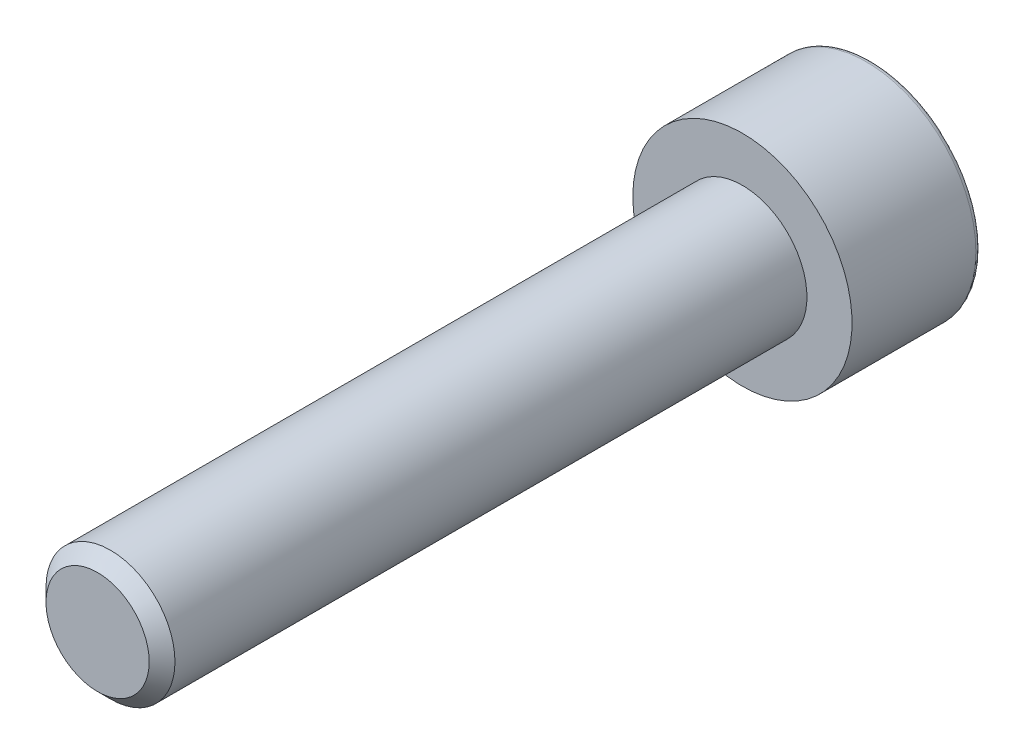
ISO-10303-21;
HEADER;
FILE_DESCRIPTION(('STEP AP214'),'2;1');
FILE_NAME('part.step','',(''),(''),'','','');
FILE_SCHEMA(('AUTOMOTIVE_DESIGN { 1 0 10303 214 1 1 1 1 }'));
ENDSEC;
DATA;
#1=APPLICATION_CONTEXT('core data for automotive mechanical design processes');
#2=APPLICATION_PROTOCOL_DEFINITION('international standard','automotive_design',2000,#1);
#3=PRODUCT_CONTEXT('',#1,'mechanical');
#4=PRODUCT('Part','Part','',(#3));
#5=PRODUCT_RELATED_PRODUCT_CATEGORY('part','',(#4));
#6=PRODUCT_DEFINITION_FORMATION('','',#4);
#7=PRODUCT_DEFINITION_CONTEXT('part definition',#1,'design');
#8=PRODUCT_DEFINITION('design','',#6,#7);
#9=PRODUCT_DEFINITION_SHAPE('','',#8);
#10=(LENGTH_UNIT() NAMED_UNIT(*) SI_UNIT(.MILLI.,.METRE.));
#11=(NAMED_UNIT(*) PLANE_ANGLE_UNIT() SI_UNIT($,.RADIAN.));
#12=(NAMED_UNIT(*) SI_UNIT($,.STERADIAN.) SOLID_ANGLE_UNIT());
#13=UNCERTAINTY_MEASURE_WITH_UNIT(LENGTH_MEASURE(1.E-05),#10,'distance_accuracy_value','');
#14=(GEOMETRIC_REPRESENTATION_CONTEXT(3) GLOBAL_UNCERTAINTY_ASSIGNED_CONTEXT((#13)) GLOBAL_UNIT_ASSIGNED_CONTEXT((#10,
#11,#12)) REPRESENTATION_CONTEXT('',''));
#15=CARTESIAN_POINT('',(0.,0.,0.));
#16=DIRECTION('',(0.,0.,1.));
#17=DIRECTION('',(1.,0.,0.));
#18=AXIS2_PLACEMENT_3D('',#15,#16,#17);
#19=CARTESIAN_POINT('',(0.,0.,0.));
#20=DIRECTION('',(0.,0.,1.));
#21=DIRECTION('',(1.,0.,0.));
#22=AXIS2_PLACEMENT_3D('',#19,#20,#21);
#23=PLANE('',#22);
#24=CARTESIAN_POINT('',(0.,0.,0.));
#25=DIRECTION('',(0.,0.,1.));
#26=DIRECTION('',(1.,0.,0.));
#27=AXIS2_PLACEMENT_3D('',#24,#25,#26);
#28=CIRCLE('',#27,4.05);
#29=CARTESIAN_POINT('',(4.05,0.,0.));
#30=VERTEX_POINT('',#29);
#31=EDGE_CURVE('E44',#30,#30,#28,.F.);
#32=ORIENTED_EDGE('',*,*,#31,.T.);
#33=EDGE_LOOP('',(#32));
#34=FACE_BOUND('',#33,.T.);
#35=CARTESIAN_POINT('',(0.,0.,0.));
#36=DIRECTION('',(0.,0.,-1.));
#37=DIRECTION('',(-1.,0.,0.));
#38=AXIS2_PLACEMENT_3D('',#35,#36,#37);
#39=CIRCLE('',#38,2.3094010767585);
#40=CARTESIAN_POINT('',(2.3094010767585,0.,0.));
#41=VERTEX_POINT('',#40);
#42=CARTESIAN_POINT('',(1.15470053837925,-2.,0.));
#43=VERTEX_POINT('',#42);
#44=EDGE_CURVE('E50',#41,#43,#39,.T.);
#45=ORIENTED_EDGE('',*,*,#44,.F.);
#46=CARTESIAN_POINT('',(1.15470053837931,1.99999999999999,0.));
#47=VERTEX_POINT('',#46);
#48=EDGE_CURVE('E57',#47,#41,#39,.T.);
#49=ORIENTED_EDGE('',*,*,#48,.F.);
#50=CARTESIAN_POINT('',(-1.15470053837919,2.,0.));
#51=VERTEX_POINT('',#50);
#52=EDGE_CURVE('E151',#51,#47,#39,.T.);
#53=ORIENTED_EDGE('',*,*,#52,.F.);
#54=CARTESIAN_POINT('',(-2.3094010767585,0.,0.));
#55=VERTEX_POINT('',#54);
#56=EDGE_CURVE('E148',#55,#51,#39,.T.);
#57=ORIENTED_EDGE('',*,*,#56,.F.);
#58=CARTESIAN_POINT('',(-1.15470053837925,-1.99999999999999,0.));
#59=VERTEX_POINT('',#58);
#60=EDGE_CURVE('E118',#59,#55,#39,.T.);
#61=ORIENTED_EDGE('',*,*,#60,.F.);
#62=EDGE_CURVE('E110',#43,#59,#39,.T.);
#63=ORIENTED_EDGE('',*,*,#62,.F.);
#64=EDGE_LOOP('',(#45,#49,#53,#57,#61,#63));
#65=FACE_BOUND('',#64,.T.);
#66=ADVANCED_FACE('F31',(#34,#65),#23,.F.);
#67=CARTESIAN_POINT('',(0.,-4.25,5.));
#68=DIRECTION('',(0.,0.,-1.));
#69=DIRECTION('',(-1.,0.,0.));
#70=AXIS2_PLACEMENT_3D('',#67,#68,#69);
#71=PLANE('',#70);
#72=CARTESIAN_POINT('',(0.,0.,5.));
#73=DIRECTION('',(0.,0.,1.));
#74=DIRECTION('',(1.,0.,0.));
#75=AXIS2_PLACEMENT_3D('',#72,#73,#74);
#76=CIRCLE('',#75,4.25);
#77=CARTESIAN_POINT('',(-4.25,0.,5.));
#78=VERTEX_POINT('',#77);
#79=EDGE_CURVE('E136',#78,#78,#76,.T.);
#80=ORIENTED_EDGE('',*,*,#79,.T.);
#81=EDGE_LOOP('',(#80));
#82=FACE_BOUND('',#81,.T.);
#83=CARTESIAN_POINT('',(0.,0.,5.));
#84=DIRECTION('',(0.,0.,-1.));
#85=DIRECTION('',(-1.,0.,0.));
#86=AXIS2_PLACEMENT_3D('',#83,#84,#85);
#87=CIRCLE('',#86,2.5);
#88=CARTESIAN_POINT('',(-2.5,0.,5.));
#89=VERTEX_POINT('',#88);
#90=EDGE_CURVE('E184',#89,#89,#87,.F.);
#91=ORIENTED_EDGE('',*,*,#90,.F.);
#92=EDGE_LOOP('',(#91));
#93=FACE_BOUND('',#92,.T.);
#94=ADVANCED_FACE('F209',(#82,#93),#71,.F.);
#95=CARTESIAN_POINT('',(0.,0.,2.975));
#96=DIRECTION('',(0.,0.,-1.));
#97=DIRECTION('',(-1.,0.,0.));
#98=AXIS2_PLACEMENT_3D('',#95,#96,#97);
#99=CYLINDRICAL_SURFACE('',#98,4.25);
#100=CARTESIAN_POINT('',(0.,0.,0.199999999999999));
#101=DIRECTION('',(0.,0.,1.));
#102=DIRECTION('',(1.,0.,0.));
#103=AXIS2_PLACEMENT_3D('',#100,#101,#102);
#104=CIRCLE('',#103,4.25);
#105=CARTESIAN_POINT('',(-4.25,0.,0.199999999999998));
#106=VERTEX_POINT('',#105);
#107=EDGE_CURVE('E193',#106,#106,#104,.T.);
#108=CARTESIAN_POINT('',(-4.25,0.,0.199999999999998));
#109=CARTESIAN_POINT('',(-4.25,0.,0.249999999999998));
#110=CARTESIAN_POINT('',(-4.25,0.,0.299999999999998));
#111=CARTESIAN_POINT('',(-4.25,0.,0.399999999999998));
#112=CARTESIAN_POINT('',(-4.25,0.,0.449999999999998));
#113=CARTESIAN_POINT('',(-4.25,0.,0.549999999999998));
#114=CARTESIAN_POINT('',(-4.25,0.,0.599999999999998));
#115=CARTESIAN_POINT('',(-4.25,0.,0.699999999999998));
#116=CARTESIAN_POINT('',(-4.25,0.,0.749999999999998));
#117=CARTESIAN_POINT('',(-4.25,0.,0.849999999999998));
#118=CARTESIAN_POINT('',(-4.25,0.,0.899999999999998));
#119=CARTESIAN_POINT('',(-4.25,0.,0.999999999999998));
#120=CARTESIAN_POINT('',(-4.25,0.,1.05));
#121=CARTESIAN_POINT('',(-4.25,0.,1.15));
#122=CARTESIAN_POINT('',(-4.25,0.,1.2));
#123=CARTESIAN_POINT('',(-4.25,0.,1.3));
#124=CARTESIAN_POINT('',(-4.25,0.,1.35));
#125=CARTESIAN_POINT('',(-4.25,0.,1.45));
#126=CARTESIAN_POINT('',(-4.25,0.,1.5));
#127=CARTESIAN_POINT('',(-4.25,0.,1.6));
#128=CARTESIAN_POINT('',(-4.25,0.,1.65));
#129=CARTESIAN_POINT('',(-4.25,0.,1.75));
#130=CARTESIAN_POINT('',(-4.25,0.,1.8));
#131=CARTESIAN_POINT('',(-4.25,0.,1.9));
#132=CARTESIAN_POINT('',(-4.25,0.,1.95));
#133=CARTESIAN_POINT('',(-4.25,0.,2.05));
#134=CARTESIAN_POINT('',(-4.25,0.,2.1));
#135=CARTESIAN_POINT('',(-4.25,0.,2.2));
#136=CARTESIAN_POINT('',(-4.25,0.,2.25));
#137=CARTESIAN_POINT('',(-4.25,0.,2.35));
#138=CARTESIAN_POINT('',(-4.25,0.,2.4));
#139=CARTESIAN_POINT('',(-4.25,0.,2.5));
#140=CARTESIAN_POINT('',(-4.25,0.,2.55));
#141=CARTESIAN_POINT('',(-4.25,0.,2.65));
#142=CARTESIAN_POINT('',(-4.25,0.,2.7));
#143=CARTESIAN_POINT('',(-4.25,0.,2.8));
#144=CARTESIAN_POINT('',(-4.25,0.,2.85));
#145=CARTESIAN_POINT('',(-4.25,0.,2.95));
#146=CARTESIAN_POINT('',(-4.25,0.,3.));
#147=CARTESIAN_POINT('',(-4.25,0.,3.1));
#148=CARTESIAN_POINT('',(-4.25,0.,3.15));
#149=CARTESIAN_POINT('',(-4.25,0.,3.25));
#150=CARTESIAN_POINT('',(-4.25,0.,3.3));
#151=CARTESIAN_POINT('',(-4.25,0.,3.4));
#152=CARTESIAN_POINT('',(-4.25,0.,3.45));
#153=CARTESIAN_POINT('',(-4.25,0.,3.55));
#154=CARTESIAN_POINT('',(-4.25,0.,3.6));
#155=CARTESIAN_POINT('',(-4.25,0.,3.7));
#156=CARTESIAN_POINT('',(-4.25,0.,3.75));
#157=CARTESIAN_POINT('',(-4.25,0.,3.85));
#158=CARTESIAN_POINT('',(-4.25,0.,3.9));
#159=CARTESIAN_POINT('',(-4.25,0.,4.));
#160=CARTESIAN_POINT('',(-4.25,0.,4.05));
#161=CARTESIAN_POINT('',(-4.25,0.,4.15));
#162=CARTESIAN_POINT('',(-4.25,0.,4.2));
#163=CARTESIAN_POINT('',(-4.25,0.,4.3));
#164=CARTESIAN_POINT('',(-4.25,0.,4.35));
#165=CARTESIAN_POINT('',(-4.25,0.,4.45));
#166=CARTESIAN_POINT('',(-4.25,0.,4.5));
#167=CARTESIAN_POINT('',(-4.25,0.,4.6));
#168=CARTESIAN_POINT('',(-4.25,0.,4.65));
#169=CARTESIAN_POINT('',(-4.25,0.,4.75));
#170=CARTESIAN_POINT('',(-4.25,0.,4.8));
#171=CARTESIAN_POINT('',(-4.25,0.,4.9));
#172=CARTESIAN_POINT('',(-4.25,0.,4.95));
#173=CARTESIAN_POINT('',(-4.25,0.,5.));
#174=B_SPLINE_CURVE_WITH_KNOTS('',3,(#108,#109,#110,#111,#112,#113,#114,#115,#116,#117,#118,
#119,#120,#121,#122,#123,#124,#125,#126,#127,#128,#129,#130,#131,#132,#133,#134,#135,#136,#137,
#138,#139,#140,#141,#142,#143,#144,#145,#146,#147,#148,#149,#150,#151,#152,#153,#154,#155,#156,
#157,#158,#159,#160,#161,#162,#163,#164,#165,#166,#167,#168,#169,#170,#171,#172,#173),
.UNSPECIFIED.,.F.,.F.,(4,2,2,2,2,2,2,2,2,2,2,2,2,2,2,2,2,2,2,2,2,2,2,2,2,2,2,2,2,2,2,2,4),(0.,
0.15,0.3,0.45,0.6,0.75,0.9,1.05,1.2,1.35,1.5,1.65,1.8,1.95,2.1,2.25,2.4,2.55,2.7,2.85,3.,3.15,
3.3,3.45,3.6,3.75,3.9,4.05,4.2,4.35,4.5,4.65,4.8),.UNSPECIFIED.);
#175=EDGE_CURVE('BSEAM33',#106,#78,#174,.T.);
#176=ORIENTED_EDGE('',*,*,#107,.T.);
#177=ORIENTED_EDGE('',*,*,#79,.F.);
#178=ORIENTED_EDGE('',*,*,#175,.T.);
#179=ORIENTED_EDGE('',*,*,#175,.F.);
#180=EDGE_LOOP('',(#176,#178,#177,#179));
#181=FACE_BOUND('',#180,.T.);
#182=ADVANCED_FACE('F33',(#181),#99,.T.);
#183=CARTESIAN_POINT('',(0.,0.,30.));
#184=DIRECTION('',(0.,0.,-1.));
#185=DIRECTION('',(-1.,0.,0.));
#186=AXIS2_PLACEMENT_3D('',#183,#184,#185);
#187=CYLINDRICAL_SURFACE('',#186,2.5);
#188=CARTESIAN_POINT('',(0.,0.,29.5));
#189=DIRECTION('',(0.,0.,1.));
#190=DIRECTION('',(1.,0.,0.));
#191=AXIS2_PLACEMENT_3D('',#188,#189,#190);
#192=CIRCLE('',#191,2.5);
#193=CARTESIAN_POINT('',(2.5,0.,29.5));
#194=VERTEX_POINT('',#193);
#195=EDGE_CURVE('E190',#194,#194,#192,.F.);
#196=ORIENTED_EDGE('',*,*,#195,.T.);
#197=EDGE_LOOP('',(#196));
#198=FACE_BOUND('',#197,.T.);
#199=ORIENTED_EDGE('',*,*,#90,.T.);
#200=EDGE_LOOP('',(#199));
#201=FACE_BOUND('',#200,.T.);
#202=ADVANCED_FACE('F208',(#198,#201),#187,.T.);
#203=CARTESIAN_POINT('',(0.,0.,30.));
#204=DIRECTION('',(0.,0.,1.));
#205=DIRECTION('',(1.,0.,0.));
#206=AXIS2_PLACEMENT_3D('',#203,#204,#205);
#207=PLANE('',#206);
#208=CARTESIAN_POINT('',(0.,0.,30.));
#209=DIRECTION('',(0.,0.,1.));
#210=DIRECTION('',(1.,0.,0.));
#211=AXIS2_PLACEMENT_3D('',#208,#209,#210);
#212=CIRCLE('',#211,1.99999999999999);
#213=CARTESIAN_POINT('',(1.99999999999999,0.,30.));
#214=VERTEX_POINT('',#213);
#215=EDGE_CURVE('E187',#214,#214,#212,.T.);
#216=ORIENTED_EDGE('',*,*,#215,.T.);
#217=EDGE_LOOP('',(#216));
#218=FACE_BOUND('',#217,.T.);
#219=ADVANCED_FACE('F346',(#218),#207,.T.);
#220=CARTESIAN_POINT('',(0.,0.,30.));
#221=DIRECTION('',(0.,0.,-1.));
#222=DIRECTION('',(-1.,0.,0.));
#223=AXIS2_PLACEMENT_3D('',#220,#221,#222);
#224=CONICAL_SURFACE('',#223,1.99999999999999,0.785398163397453);
#225=ORIENTED_EDGE('',*,*,#195,.F.);
#226=EDGE_LOOP('',(#225));
#227=FACE_BOUND('',#226,.T.);
#228=ORIENTED_EDGE('',*,*,#215,.F.);
#229=EDGE_LOOP('',(#228));
#230=FACE_BOUND('',#229,.T.);
#231=ADVANCED_FACE('F202',(#227,#230),#224,.T.);
#232=CARTESIAN_POINT('',(0.,0.,0.199999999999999));
#233=DIRECTION('',(0.,0.,1.));
#234=DIRECTION('',(1.,0.,0.));
#235=AXIS2_PLACEMENT_3D('',#232,#233,#234);
#236=TOROIDAL_SURFACE('',#235,4.05,0.2);
#237=ORIENTED_EDGE('',*,*,#31,.F.);
#238=EDGE_LOOP('',(#237));
#239=FACE_BOUND('',#238,.T.);
#240=ORIENTED_EDGE('',*,*,#107,.F.);
#241=EDGE_LOOP('',(#240));
#242=FACE_BOUND('',#241,.T.);
#243=ADVANCED_FACE('F199',(#239,#242),#236,.T.);
#244=CARTESIAN_POINT('',(0.,0.,1.33333333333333));
#245=DIRECTION('',(0.,0.,-1.));
#246=DIRECTION('',(-1.,0.,0.));
#247=AXIS2_PLACEMENT_3D('',#244,#245,#246);
#248=CONICAL_SURFACE('',#247,0.,1.0471975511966);
#249=ORIENTED_EDGE('',*,*,#60,.T.);
#250=CARTESIAN_POINT('',(-1.15458506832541,-2.00019999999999,-6.66716664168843E-05));
#251=CARTESIAN_POINT('',(-1.20532911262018,-1.91230873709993,0.0292432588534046));
#252=CARTESIAN_POINT('',(-1.2565111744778,-1.8236588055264,0.0558999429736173));
#253=CARTESIAN_POINT('',(-1.35976164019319,-1.64482375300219,0.102430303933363));
#254=CARTESIAN_POINT('',(-1.41183187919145,-1.55463545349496,0.122287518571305));
#255=CARTESIAN_POINT('',(-1.51532701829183,-1.37537661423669,0.153199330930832));
#256=CARTESIAN_POINT('',(-1.56673599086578,-1.28633366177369,0.164459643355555));
#257=CARTESIAN_POINT('',(-1.66979593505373,-1.10782860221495,0.177904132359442));
#258=CARTESIAN_POINT('',(-1.72144653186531,-1.01836714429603,0.180099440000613));
#259=CARTESIAN_POINT('',(-1.81796535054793,-0.851191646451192,0.175541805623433));
#260=CARTESIAN_POINT('',(-1.86284799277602,-0.773452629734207,0.16990792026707));
#261=CARTESIAN_POINT('',(-1.95232085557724,-0.618481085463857,0.152048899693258));
#262=CARTESIAN_POINT('',(-1.99691076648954,-0.541249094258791,0.139817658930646));
#263=CARTESIAN_POINT('',(-2.08656822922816,-0.385957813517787,0.109239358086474));
#264=CARTESIAN_POINT('',(-2.13162442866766,-0.307918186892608,0.0907626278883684));
#265=CARTESIAN_POINT('',(-2.221064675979,-0.153003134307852,0.0488272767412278));
#266=CARTESIAN_POINT('',(-2.26544987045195,-0.0761257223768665,0.0253785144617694));
#267=CARTESIAN_POINT('',(-2.30951654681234,0.000200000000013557,-6.66716664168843E-05));
#268=B_SPLINE_CURVE_WITH_KNOTS('',3,(#250,#251,#252,#253,#254,#255,#256,#257,#258,#259,#260,
#261,#262,#263,#264,#265,#266,#267),.UNSPECIFIED.,.F.,.F.,(4,2,2,2,2,2,2,2,4),(0.,
0.31703182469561,0.634825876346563,0.944753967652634,1.25430138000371,1.52387047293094,
1.79368946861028,2.06949491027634,2.34475850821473),.UNSPECIFIED.);
#269=EDGE_CURVE('E11',#59,#55,#268,.T.);
#270=ORIENTED_EDGE('',*,*,#269,.F.);
#271=EDGE_LOOP('',(#249,#270));
#272=FACE_BOUND('',#271,.T.);
#273=ADVANCED_FACE('F122',(#272),#248,.F.);
#274=ORIENTED_EDGE('',*,*,#56,.T.);
#275=CARTESIAN_POINT('',(-2.30951654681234,-0.000199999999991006,-6.66716664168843E-05));
#276=CARTESIAN_POINT('',(-2.25877250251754,0.0876912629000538,0.0292432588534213));
#277=CARTESIAN_POINT('',(-2.20759044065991,0.176341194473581,0.0558999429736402));
#278=CARTESIAN_POINT('',(-2.10433997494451,0.355176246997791,0.10243030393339));
#279=CARTESIAN_POINT('',(-2.05226973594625,0.445364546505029,0.12228751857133));
#280=CARTESIAN_POINT('',(-1.94877459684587,0.624623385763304,0.15319933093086));
#281=CARTESIAN_POINT('',(-1.89736562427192,0.713666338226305,0.164459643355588));
#282=CARTESIAN_POINT('',(-1.79430568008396,0.892171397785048,0.177904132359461));
#283=CARTESIAN_POINT('',(-1.74265508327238,0.981632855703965,0.180099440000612));
#284=CARTESIAN_POINT('',(-1.64613626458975,1.14880835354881,0.175541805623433));
#285=CARTESIAN_POINT('',(-1.60125362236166,1.2265473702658,0.169907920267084));
#286=CARTESIAN_POINT('',(-1.51178075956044,1.38151891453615,0.152048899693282));
#287=CARTESIAN_POINT('',(-1.46719084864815,1.45875090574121,0.139817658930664));
#288=CARTESIAN_POINT('',(-1.37753338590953,1.61404218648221,0.109239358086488));
#289=CARTESIAN_POINT('',(-1.33247718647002,1.69208181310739,0.0907626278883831));
#290=CARTESIAN_POINT('',(-1.24303693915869,1.84699686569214,0.0488272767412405));
#291=CARTESIAN_POINT('',(-1.19865174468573,1.92387427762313,0.0253785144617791));
#292=CARTESIAN_POINT('',(-1.15458506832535,2.00020000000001,-6.66716664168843E-05));
#293=B_SPLINE_CURVE_WITH_KNOTS('',3,(#275,#276,#277,#278,#279,#280,#281,#282,#283,#284,#285,
#286,#287,#288,#289,#290,#291,#292),.UNSPECIFIED.,.F.,.F.,(4,2,2,2,2,2,2,2,4),(0.,
0.317031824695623,0.634825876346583,0.944753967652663,1.25430138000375,1.52387047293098,
1.79368946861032,2.06949491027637,2.34475850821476),.UNSPECIFIED.);
#294=EDGE_CURVE('E150',#55,#51,#293,.T.);
#295=ORIENTED_EDGE('',*,*,#294,.F.);
#296=EDGE_LOOP('',(#274,#295));
#297=FACE_BOUND('',#296,.T.);
#298=ADVANCED_FACE('F280',(#297),#248,.F.);
#299=ORIENTED_EDGE('',*,*,#52,.T.);
#300=CARTESIAN_POINT('',(-2.9902902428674,2.,-0.743670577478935));
#301=CARTESIAN_POINT('',(-2.90392335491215,2.,-0.702235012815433));
#302=CARTESIAN_POINT('',(-2.8173460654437,2.,-0.66122983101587));
#303=CARTESIAN_POINT('',(-2.6436585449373,2.,-0.580324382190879));
#304=CARTESIAN_POINT('',(-2.55654822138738,2.,-0.540424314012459));
#305=CARTESIAN_POINT('',(-2.38118302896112,2.,-0.461750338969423));
#306=CARTESIAN_POINT('',(-2.29292442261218,2.,-0.422984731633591));
#307=CARTESIAN_POINT('',(-2.11566660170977,2.,-0.347191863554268));
#308=CARTESIAN_POINT('',(-2.02666742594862,2.,-0.310164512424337));
#309=CARTESIAN_POINT('',(-1.84544249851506,2.,-0.237368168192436));
#310=CARTESIAN_POINT('',(-1.75319322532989,2.,-0.201657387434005));
#311=CARTESIAN_POINT('',(-1.56757885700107,2.,-0.133204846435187));
#312=CARTESIAN_POINT('',(-1.47421363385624,2.,-0.100463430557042));
#313=CARTESIAN_POINT('',(-1.28643446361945,2.,-0.0388859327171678));
#314=CARTESIAN_POINT('',(-1.19202351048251,2.,-0.0100408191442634));
#315=CARTESIAN_POINT('',(-1.00184859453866,2.,0.0427576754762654));
#316=CARTESIAN_POINT('',(-0.906084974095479,1.99999999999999,0.0667122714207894));
#317=CARTESIAN_POINT('',(-0.713403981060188,1.99999999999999,0.108452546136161));
#318=CARTESIAN_POINT('',(-0.616489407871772,2.,0.126250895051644));
#319=CARTESIAN_POINT('',(-0.421576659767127,2.,0.154514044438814));
#320=CARTESIAN_POINT('',(-0.323578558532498,2.,0.164979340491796));
#321=CARTESIAN_POINT('',(-0.12821241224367,2.,0.177602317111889));
#322=CARTESIAN_POINT('',(-0.0308508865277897,2.,0.179858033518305));
#323=CARTESIAN_POINT('',(0.163710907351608,2.,0.176133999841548));
#324=CARTESIAN_POINT('',(0.260911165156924,2.,0.170153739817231));
#325=CARTESIAN_POINT('',(0.500738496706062,1.99999999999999,0.145763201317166));
#326=CARTESIAN_POINT('',(0.642900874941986,2.,0.122782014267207));
#327=CARTESIAN_POINT('',(0.92446105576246,2.,0.0635202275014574));
#328=CARTESIAN_POINT('',(1.06385531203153,2.,0.0272235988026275));
#329=CARTESIAN_POINT('',(1.27233476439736,1.99999999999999,-0.0347799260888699));
#330=CARTESIAN_POINT('',(1.34249760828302,1.99999999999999,-0.0569967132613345));
#331=CARTESIAN_POINT('',(1.48209294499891,1.99999999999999,-0.103485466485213));
#332=CARTESIAN_POINT('',(1.55152586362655,1.99999999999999,-0.127756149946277));
#333=CARTESIAN_POINT('',(1.68975413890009,1.99999999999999,-0.178000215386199));
#334=CARTESIAN_POINT('',(1.75854960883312,1.99999999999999,-0.203973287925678));
#335=CARTESIAN_POINT('',(1.89559846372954,1.99999999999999,-0.257341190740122));
#336=CARTESIAN_POINT('',(1.96385175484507,1.99999999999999,-0.284736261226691));
#337=CARTESIAN_POINT('',(2.13807099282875,1.99999999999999,-0.356418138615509));
#338=CARTESIAN_POINT('',(2.24368858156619,1.99999999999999,-0.401550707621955));
#339=CARTESIAN_POINT('',(2.45396999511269,1.99999999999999,-0.493991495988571));
#340=CARTESIAN_POINT('',(2.55863374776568,1.99999999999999,-0.541299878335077));
#341=CARTESIAN_POINT('',(2.87151206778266,1.99999999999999,-0.685721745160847));
#342=CARTESIAN_POINT('',(3.07857874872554,1.99999999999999,-0.785317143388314));
#343=CARTESIAN_POINT('',(3.4909430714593,1.99999999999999,-0.988684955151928));
#344=CARTESIAN_POINT('',(3.69623822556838,1.99999999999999,-1.09246235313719));
#345=CARTESIAN_POINT('',(4.10542196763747,1.99999999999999,-1.30268560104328));
#346=CARTESIAN_POINT('',(4.30931073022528,1.99999999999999,-1.40913111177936));
#347=CARTESIAN_POINT('',(4.69691639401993,1.99999999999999,-1.61372651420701));
#348=CARTESIAN_POINT('',(4.88072085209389,1.99999999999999,-1.7117111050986));
#349=CARTESIAN_POINT('',(5.24773852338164,1.99999999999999,-1.90879672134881));
#350=CARTESIAN_POINT('',(5.43095171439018,1.99999999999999,-2.00789778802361));
#351=CARTESIAN_POINT('',(5.79645714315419,1.99999999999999,-2.20668324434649));
#352=CARTESIAN_POINT('',(5.97875053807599,2.,-2.30636550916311));
#353=CARTESIAN_POINT('',(6.3429687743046,1.99999999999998,-2.50637882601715));
#354=CARTESIAN_POINT('',(6.52489363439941,1.99999999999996,-2.60670984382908));
#355=CARTESIAN_POINT('',(6.70668608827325,1.99999999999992,-2.70727876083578));
#356=B_SPLINE_CURVE_WITH_KNOTS('',3,(#300,#301,#302,#303,#304,#305,#306,#307,#308,#309,#310,
#311,#312,#313,#314,#315,#316,#317,#318,#319,#320,#321,#322,#323,#324,#325,#326,#327,#328,#329,
#330,#331,#332,#333,#334,#335,#336,#337,#338,#339,#340,#341,#342,#343,#344,#345,#346,#347,#348,
#349,#350,#351,#352,#353,#354,#355),.UNSPECIFIED.,.F.,.F.,(4,2,2,2,2,2,2,2,2,2,2,2,2,2,2,2,2,2,
2,2,2,2,2,2,2,2,2,4),(0.,0.287380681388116,0.574812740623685,0.863988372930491,1.15314895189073,
1.44986982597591,1.74662506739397,2.04268017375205,2.33866164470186,2.63403028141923,
2.92937895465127,3.2211888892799,3.51301689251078,3.94415417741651,4.37581217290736,
4.59657665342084,4.81720427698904,5.03779190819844,5.25841692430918,5.60295100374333,
5.94751093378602,6.6367445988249,7.32682556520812,8.01681924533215,8.6416872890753,
9.26657853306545,9.88988035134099,10.5131495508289),.UNSPECIFIED.);
#357=EDGE_CURVE('E155',#51,#47,#356,.T.);
#358=ORIENTED_EDGE('',*,*,#357,.F.);
#359=EDGE_LOOP('',(#299,#358));
#360=FACE_BOUND('',#359,.T.);
#361=ADVANCED_FACE('F158',(#360),#248,.F.);
#362=ORIENTED_EDGE('',*,*,#48,.T.);
#363=CARTESIAN_POINT('',(1.15458506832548,2.00019999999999,-6.66716664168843E-05));
#364=CARTESIAN_POINT('',(1.20532911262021,1.91230873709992,0.0292432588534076));
#365=CARTESIAN_POINT('',(1.25651117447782,1.82365880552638,0.0558999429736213));
#366=CARTESIAN_POINT('',(1.3597616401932,1.64482375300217,0.102430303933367));
#367=CARTESIAN_POINT('',(1.41183187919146,1.55463545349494,0.122287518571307));
#368=CARTESIAN_POINT('',(1.51532701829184,1.37537661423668,0.153199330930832));
#369=CARTESIAN_POINT('',(1.56673599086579,1.28633366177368,0.164459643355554));
#370=CARTESIAN_POINT('',(1.66979593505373,1.10782860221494,0.177904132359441));
#371=CARTESIAN_POINT('',(1.72144653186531,1.01836714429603,0.180099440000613));
#372=CARTESIAN_POINT('',(1.81796535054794,0.851191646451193,0.175541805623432));
#373=CARTESIAN_POINT('',(1.86284799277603,0.773452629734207,0.169907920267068));
#374=CARTESIAN_POINT('',(1.95232085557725,0.618481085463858,0.152048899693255));
#375=CARTESIAN_POINT('',(1.99691076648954,0.541249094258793,0.139817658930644));
#376=CARTESIAN_POINT('',(2.08656822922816,0.385957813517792,0.109239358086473));
#377=CARTESIAN_POINT('',(2.13162442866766,0.307918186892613,0.0907626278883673));
#378=CARTESIAN_POINT('',(2.221064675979,0.153003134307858,0.0488272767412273));
#379=CARTESIAN_POINT('',(2.26544987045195,0.0761257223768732,0.0253785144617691));
#380=CARTESIAN_POINT('',(2.30951654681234,-0.000200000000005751,-6.66716664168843E-05));
#381=B_SPLINE_CURVE_WITH_KNOTS('',3,(#363,#364,#365,#366,#367,#368,#369,#370,#371,#372,#373,
#374,#375,#376,#377,#378,#379,#380),.UNSPECIFIED.,.F.,.F.,(4,2,2,2,2,2,2,2,4),(0.,
0.317031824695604,0.63482587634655,0.944753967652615,1.25430138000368,1.52387047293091,
1.79368946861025,2.06949491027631,2.34475850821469),.UNSPECIFIED.);
#382=EDGE_CURVE('E163',#47,#41,#381,.T.);
#383=ORIENTED_EDGE('',*,*,#382,.F.);
#384=EDGE_LOOP('',(#362,#383));
#385=FACE_BOUND('',#384,.T.);
#386=ADVANCED_FACE('F421',(#385),#248,.F.);
#387=ORIENTED_EDGE('',*,*,#44,.T.);
#388=CARTESIAN_POINT('',(2.30951654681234,0.000199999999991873,-6.66716664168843E-05));
#389=CARTESIAN_POINT('',(2.25877250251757,-0.0876912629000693,0.0292432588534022));
#390=CARTESIAN_POINT('',(2.20759044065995,-0.176341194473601,0.0558999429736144));
#391=CARTESIAN_POINT('',(2.10433997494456,-0.355176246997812,0.10243030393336));
#392=CARTESIAN_POINT('',(2.0522697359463,-0.445364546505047,0.122287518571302));
#393=CARTESIAN_POINT('',(1.94877459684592,-0.624623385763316,0.153199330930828));
#394=CARTESIAN_POINT('',(1.89736562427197,-0.713666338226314,0.16445964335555));
#395=CARTESIAN_POINT('',(1.79430568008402,-0.892171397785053,0.177904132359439));
#396=CARTESIAN_POINT('',(1.74265508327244,-0.981632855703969,0.180099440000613));
#397=CARTESIAN_POINT('',(1.64613626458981,-1.14880835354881,0.175541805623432));
#398=CARTESIAN_POINT('',(1.60125362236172,-1.22654737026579,0.169907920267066));
#399=CARTESIAN_POINT('',(1.5117807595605,-1.38151891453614,0.152048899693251));
#400=CARTESIAN_POINT('',(1.46719084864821,-1.4587509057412,0.139817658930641));
#401=CARTESIAN_POINT('',(1.37753338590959,-1.6140421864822,0.109239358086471));
#402=CARTESIAN_POINT('',(1.33247718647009,-1.69208181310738,0.0907626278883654));
#403=CARTESIAN_POINT('',(1.24303693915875,-1.84699686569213,0.0488272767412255));
#404=CARTESIAN_POINT('',(1.1986517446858,-1.92387427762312,0.0253785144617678));
#405=CARTESIAN_POINT('',(1.15458506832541,-2.00019999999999,-6.66716664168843E-05));
#406=B_SPLINE_CURVE_WITH_KNOTS('',3,(#388,#389,#390,#391,#392,#393,#394,#395,#396,#397,#398,
#399,#400,#401,#402,#403,#404,#405),.UNSPECIFIED.,.F.,.F.,(4,2,2,2,2,2,2,2,4),(0.,
0.31703182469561,0.634825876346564,0.944753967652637,1.25430138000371,1.52387047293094,
1.79368946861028,2.06949491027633,2.34475850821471),.UNSPECIFIED.);
#407=EDGE_CURVE('E137',#41,#43,#406,.T.);
#408=ORIENTED_EDGE('',*,*,#407,.F.);
#409=EDGE_LOOP('',(#387,#408));
#410=FACE_BOUND('',#409,.T.);
#411=ADVANCED_FACE('F423',(#410),#248,.F.);
#412=ORIENTED_EDGE('',*,*,#62,.T.);
#413=CARTESIAN_POINT('',(-2.99029024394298,-1.99999999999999,-0.743670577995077));
#414=CARTESIAN_POINT('',(-2.90392335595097,-1.99999999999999,-0.702235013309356));
#415=CARTESIAN_POINT('',(-2.81734606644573,-1.99999999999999,-0.661229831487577));
#416=CARTESIAN_POINT('',(-2.64365854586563,-1.99999999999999,-0.580324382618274));
#417=CARTESIAN_POINT('',(-2.5565482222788,-1.99999999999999,-0.540424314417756));
#418=CARTESIAN_POINT('',(-2.38118302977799,-1.99999999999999,-0.461750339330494));
#419=CARTESIAN_POINT('',(-2.29292442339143,-1.99999999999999,-0.42298473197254));
#420=CARTESIAN_POINT('',(-2.11566660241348,-1.99999999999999,-0.347191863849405));
#421=CARTESIAN_POINT('',(-2.02666742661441,-1.99999999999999,-0.310164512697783));
#422=CARTESIAN_POINT('',(-1.84544249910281,-1.99999999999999,-0.237368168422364));
#423=CARTESIAN_POINT('',(-1.7531932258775,-1.99999999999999,-0.201657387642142));
#424=CARTESIAN_POINT('',(-1.56757885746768,-1.99999999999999,-0.133204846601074));
#425=CARTESIAN_POINT('',(-1.47421363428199,-1.99999999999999,-0.100463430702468));
#426=CARTESIAN_POINT('',(-1.28643446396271,-1.99999999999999,-0.0388859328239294));
#427=CARTESIAN_POINT('',(-1.19202351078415,-1.99999999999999,-0.0100408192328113));
#428=CARTESIAN_POINT('',(-1.00184859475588,-1.99999999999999,0.0427576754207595));
#429=CARTESIAN_POINT('',(-0.906084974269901,-1.99999999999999,0.066712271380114));
#430=CARTESIAN_POINT('',(-0.713403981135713,-1.99999999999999,0.108452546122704));
#431=CARTESIAN_POINT('',(-0.616489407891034,-1.99999999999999,0.126250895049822));
#432=CARTESIAN_POINT('',(-0.421576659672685,-1.99999999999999,0.154514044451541));
#433=CARTESIAN_POINT('',(-0.323578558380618,-1.99999999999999,0.164979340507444));
#434=CARTESIAN_POINT('',(-0.128212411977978,-1.99999999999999,0.177602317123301));
#435=CARTESIAN_POINT('',(-0.03085088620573,-1.99999999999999,0.179858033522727));
#436=CARTESIAN_POINT('',(0.163710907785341,-1.99999999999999,0.176133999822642));
#437=CARTESIAN_POINT('',(0.260911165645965,-1.99999999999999,0.170153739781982));
#438=CARTESIAN_POINT('',(0.500738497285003,-1.99999999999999,0.145763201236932));
#439=CARTESIAN_POINT('',(0.642900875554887,-2.,0.122782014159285));
#440=CARTESIAN_POINT('',(0.924461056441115,-2.,0.0635202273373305));
#441=CARTESIAN_POINT('',(1.06385531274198,-2.,0.0272235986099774));
#442=CARTESIAN_POINT('',(1.27233476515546,-2.,-0.0347799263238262));
#443=CARTESIAN_POINT('',(1.34249760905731,-2.,-0.0569967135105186));
#444=CARTESIAN_POINT('',(1.48209294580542,-2.,-0.103485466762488));
#445=CARTESIAN_POINT('',(1.5515258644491,-2.,-0.127756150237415));
#446=CARTESIAN_POINT('',(1.68975413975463,-2.,-0.178000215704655));
#447=CARTESIAN_POINT('',(1.75854960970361,-2.,-0.203973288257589));
#448=CARTESIAN_POINT('',(1.89559846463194,-2.,-0.257341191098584));
#449=CARTESIAN_POINT('',(1.96385175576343,-1.99999999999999,-0.28473626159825));
#450=CARTESIAN_POINT('',(2.1380709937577,-1.99999999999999,-0.356418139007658));
#451=CARTESIAN_POINT('',(2.24368858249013,-2.,-0.401550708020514));
#452=CARTESIAN_POINT('',(2.45396999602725,-2.,-0.493991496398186));
#453=CARTESIAN_POINT('',(2.55863374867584,-2.,-0.541299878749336));
#454=CARTESIAN_POINT('',(2.87151206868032,-2.,-0.685721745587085));
#455=CARTESIAN_POINT('',(3.07857874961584,-2.,-0.785317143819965));
#456=CARTESIAN_POINT('',(3.49094307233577,-2.,-0.98868495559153));
#457=CARTESIAN_POINT('',(3.69623822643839,-2.,-1.09246235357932));
#458=CARTESIAN_POINT('',(4.10542196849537,-2.,-1.30268560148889));
#459=CARTESIAN_POINT('',(4.30931073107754,-2.,-1.40913111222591));
#460=CARTESIAN_POINT('',(4.69691639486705,-2.,-1.61372651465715));
#461=CARTESIAN_POINT('',(4.88072085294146,-2.,-1.71171110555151));
#462=CARTESIAN_POINT('',(5.24773852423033,-2.,-1.90879672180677));
#463=CARTESIAN_POINT('',(5.43095171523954,-2.,-2.00789778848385));
#464=CARTESIAN_POINT('',(5.79645714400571,-2.,-2.2066832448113));
#465=CARTESIAN_POINT('',(5.97875053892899,-1.99999999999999,-2.3063655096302));
#466=CARTESIAN_POINT('',(6.3429687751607,-2.00000000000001,-2.50637882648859));
#467=CARTESIAN_POINT('',(6.52489363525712,-2.00000000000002,-2.60670984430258));
#468=CARTESIAN_POINT('',(6.70668608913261,-2.00000000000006,-2.70727876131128));
#469=B_SPLINE_CURVE_WITH_KNOTS('',3,(#413,#414,#415,#416,#417,#418,#419,#420,#421,#422,#423,
#424,#425,#426,#427,#428,#429,#430,#431,#432,#433,#434,#435,#436,#437,#438,#439,#440,#441,#442,
#443,#444,#445,#446,#447,#448,#449,#450,#451,#452,#453,#454,#455,#456,#457,#458,#459,#460,#461,
#462,#463,#464,#465,#466,#467,#468),.UNSPECIFIED.,.F.,.F.,(4,2,2,2,2,2,2,2,2,2,2,2,2,2,2,2,2,2,
2,2,2,2,2,2,2,2,2,4),(0.,0.287380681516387,0.574812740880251,0.863988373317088,1.15314895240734,
1.44986982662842,1.74662506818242,2.0426801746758,2.3386616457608,2.63403028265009,
2.92937895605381,3.22118889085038,3.51301689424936,3.94415417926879,4.37581217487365,
4.59657665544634,4.81720427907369,5.03779191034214,5.25841692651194,5.60295100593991,
5.94751093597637,6.63674460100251,7.32682556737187,8.01681924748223,8.64168729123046,
9.26657853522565,9.88988035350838,10.5131495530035),.UNSPECIFIED.);
#470=EDGE_CURVE('E114',#43,#59,#469,.F.);
#471=ORIENTED_EDGE('',*,*,#470,.F.);
#472=EDGE_LOOP('',(#412,#471));
#473=FACE_BOUND('',#472,.T.);
#474=ADVANCED_FACE('F112',(#473),#248,.F.);
#475=CARTESIAN_POINT('',(0.,0.,2.975));
#476=DIRECTION('',(0.,0.,-1.));
#477=DIRECTION('',(-1.,0.,0.));
#478=AXIS2_PLACEMENT_3D('',#475,#476,#477);
#479=CONICAL_SURFACE('',#478,1.99999999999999,1.04719755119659);
#480=CARTESIAN_POINT('',(0.,0.,4.12970053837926));
#481=VERTEX_POINT('',#480);
#482=VERTEX_LOOP('',#481);
#483=FACE_BOUND('',#482,.T.);
#484=CARTESIAN_POINT('',(0.,0.,2.975));
#485=DIRECTION('',(0.,0.,1.));
#486=DIRECTION('',(1.,0.,0.));
#487=AXIS2_PLACEMENT_3D('',#484,#485,#486);
#488=CIRCLE('',#487,1.99999999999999);
#489=CARTESIAN_POINT('',(1.73205080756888,0.999999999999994,2.975));
#490=VERTEX_POINT('',#489);
#491=CARTESIAN_POINT('',(0.,1.99999999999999,2.975));
#492=VERTEX_POINT('',#491);
#493=EDGE_CURVE('E218',#490,#492,#488,.T.);
#494=ORIENTED_EDGE('',*,*,#493,.F.);
#495=CARTESIAN_POINT('',(1.73205080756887,-1.,2.975));
#496=VERTEX_POINT('',#495);
#497=EDGE_CURVE('E213',#496,#490,#488,.T.);
#498=ORIENTED_EDGE('',*,*,#497,.F.);
#499=CARTESIAN_POINT('',(0.,-1.99999999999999,2.975));
#500=VERTEX_POINT('',#499);
#501=EDGE_CURVE('E216',#500,#496,#488,.T.);
#502=ORIENTED_EDGE('',*,*,#501,.F.);
#503=CARTESIAN_POINT('',(-1.73205080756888,-0.999999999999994,2.975));
#504=VERTEX_POINT('',#503);
#505=EDGE_CURVE('E254',#504,#500,#488,.T.);
#506=ORIENTED_EDGE('',*,*,#505,.F.);
#507=CARTESIAN_POINT('',(-1.73205080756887,1.,2.975));
#508=VERTEX_POINT('',#507);
#509=EDGE_CURVE('E247',#508,#504,#488,.T.);
#510=ORIENTED_EDGE('',*,*,#509,.F.);
#511=EDGE_CURVE('E227',#492,#508,#488,.T.);
#512=ORIENTED_EDGE('',*,*,#511,.F.);
#513=EDGE_LOOP('',(#494,#498,#502,#506,#510,#512));
#514=FACE_BOUND('',#513,.T.);
#515=ADVANCED_FACE('F379',(#483,#514),#479,.F.);
#516=CARTESIAN_POINT('',(0.,-4.25,2.975));
#517=DIRECTION('',(0.,0.,-1.));
#518=DIRECTION('',(-1.,0.,0.));
#519=AXIS2_PLACEMENT_3D('',#516,#517,#518);
#520=PLANE('',#519);
#521=DIRECTION('',(1.,0.,0.));
#522=VECTOR('',#521,1.);
#523=CARTESIAN_POINT('',(-1.15470053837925,-1.99999999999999,2.975));
#524=LINE('',#523,#522);
#525=CARTESIAN_POINT('',(1.15470053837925,-1.99999999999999,2.975));
#526=VERTEX_POINT('',#525);
#527=EDGE_CURVE('E226',#500,#526,#524,.T.);
#528=ORIENTED_EDGE('',*,*,#527,.F.);
#529=ORIENTED_EDGE('',*,*,#501,.T.);
#530=DIRECTION('',(0.500000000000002,0.866025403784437,0.));
#531=VECTOR('',#530,1.);
#532=CARTESIAN_POINT('',(1.15470053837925,-1.99999999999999,2.975));
#533=LINE('',#532,#531);
#534=EDGE_CURVE('E231',#526,#496,#533,.T.);
#535=ORIENTED_EDGE('',*,*,#534,.F.);
#536=EDGE_LOOP('',(#528,#529,#535));
#537=FACE_BOUND('',#536,.T.);
#538=ADVANCED_FACE('F261',(#537),#520,.T.);
#539=CARTESIAN_POINT('',(2.3094010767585,0.,2.975));
#540=VERTEX_POINT('',#539);
#541=EDGE_CURVE('E230',#496,#540,#533,.T.);
#542=ORIENTED_EDGE('',*,*,#541,.F.);
#543=ORIENTED_EDGE('',*,*,#497,.T.);
#544=DIRECTION('',(-0.499999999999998,0.86602540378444,0.));
#545=VECTOR('',#544,1.);
#546=CARTESIAN_POINT('',(2.3094010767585,0.,2.975));
#547=LINE('',#546,#545);
#548=EDGE_CURVE('E235',#540,#490,#547,.T.);
#549=ORIENTED_EDGE('',*,*,#548,.F.);
#550=EDGE_LOOP('',(#542,#543,#549));
#551=FACE_BOUND('',#550,.T.);
#552=ADVANCED_FACE('F373',(#551),#520,.T.);
#553=DIRECTION('',(-1.,0.,0.));
#554=VECTOR('',#553,1.);
#555=CARTESIAN_POINT('',(1.15470053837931,1.99999999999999,2.975));
#556=LINE('',#555,#554);
#557=CARTESIAN_POINT('',(1.15470053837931,1.99999999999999,2.975));
#558=VERTEX_POINT('',#557);
#559=EDGE_CURVE('E238',#558,#492,#556,.T.);
#560=ORIENTED_EDGE('',*,*,#559,.F.);
#561=EDGE_CURVE('E234',#490,#558,#547,.T.);
#562=ORIENTED_EDGE('',*,*,#561,.F.);
#563=ORIENTED_EDGE('',*,*,#493,.T.);
#564=EDGE_LOOP('',(#560,#562,#563));
#565=FACE_BOUND('',#564,.T.);
#566=ADVANCED_FACE('F368',(#565),#520,.T.);
#567=DIRECTION('',(-0.500000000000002,-0.866025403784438,0.));
#568=VECTOR('',#567,1.);
#569=CARTESIAN_POINT('',(-1.15470053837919,2.,2.975));
#570=LINE('',#569,#568);
#571=CARTESIAN_POINT('',(-1.15470053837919,2.,2.975));
#572=VERTEX_POINT('',#571);
#573=EDGE_CURVE('E241',#572,#508,#570,.T.);
#574=ORIENTED_EDGE('',*,*,#573,.F.);
#575=EDGE_CURVE('E174',#492,#572,#556,.T.);
#576=ORIENTED_EDGE('',*,*,#575,.F.);
#577=ORIENTED_EDGE('',*,*,#511,.T.);
#578=EDGE_LOOP('',(#574,#576,#577));
#579=FACE_BOUND('',#578,.T.);
#580=ADVANCED_FACE('F250',(#579),#520,.T.);
#581=DIRECTION('',(0.499999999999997,-0.86602540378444,0.));
#582=VECTOR('',#581,1.);
#583=CARTESIAN_POINT('',(-2.3094010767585,0.,2.975));
#584=LINE('',#583,#582);
#585=CARTESIAN_POINT('',(-1.15470053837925,-1.99999999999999,2.975));
#586=VERTEX_POINT('',#585);
#587=EDGE_CURVE('E142',#504,#586,#584,.T.);
#588=ORIENTED_EDGE('',*,*,#587,.F.);
#589=ORIENTED_EDGE('',*,*,#505,.T.);
#590=EDGE_CURVE('E228',#586,#500,#524,.T.);
#591=ORIENTED_EDGE('',*,*,#590,.F.);
#592=EDGE_LOOP('',(#588,#589,#591));
#593=FACE_BOUND('',#592,.T.);
#594=ADVANCED_FACE('F397',(#593),#520,.T.);
#595=CARTESIAN_POINT('',(-2.3094010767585,0.,2.975));
#596=VERTEX_POINT('',#595);
#597=EDGE_CURVE('E144',#596,#504,#584,.T.);
#598=ORIENTED_EDGE('',*,*,#597,.F.);
#599=EDGE_CURVE('E240',#508,#596,#570,.T.);
#600=ORIENTED_EDGE('',*,*,#599,.F.);
#601=ORIENTED_EDGE('',*,*,#509,.T.);
#602=EDGE_LOOP('',(#598,#600,#601));
#603=FACE_BOUND('',#602,.T.);
#604=ADVANCED_FACE('F245',(#603),#520,.T.);
#605=CARTESIAN_POINT('',(-2.3094010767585,0.,2.975));
#606=DIRECTION('',(0.86602540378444,0.499999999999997,0.));
#607=DIRECTION('',(-0.499999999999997,0.86602540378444,0.));
#608=AXIS2_PLACEMENT_3D('',#605,#606,#607);
#609=PLANE('',#608);
#610=DIRECTION('',(0.,0.,-1.));
#611=VECTOR('',#610,1.);
#612=CARTESIAN_POINT('',(-1.15470053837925,-1.99999999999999,2.975));
#613=LINE('',#612,#611);
#614=EDGE_CURVE('E132',#586,#59,#613,.T.);
#615=ORIENTED_EDGE('',*,*,#614,.T.);
#616=ORIENTED_EDGE('',*,*,#269,.T.);
#617=DIRECTION('',(0.,0.,-1.));
#618=VECTOR('',#617,1.);
#619=CARTESIAN_POINT('',(-2.3094010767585,0.,2.975));
#620=LINE('',#619,#618);
#621=EDGE_CURVE('E143',#596,#55,#620,.T.);
#622=ORIENTED_EDGE('',*,*,#621,.F.);
#623=ORIENTED_EDGE('',*,*,#597,.T.);
#624=ORIENTED_EDGE('',*,*,#587,.T.);
#625=EDGE_LOOP('',(#615,#616,#622,#623,#624));
#626=FACE_BOUND('',#625,.T.);
#627=ADVANCED_FACE('F140',(#626),#609,.T.);
#628=CARTESIAN_POINT('',(-1.15470053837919,2.,2.975));
#629=DIRECTION('',(0.866025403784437,-0.500000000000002,0.));
#630=DIRECTION('',(0.500000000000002,0.866025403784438,0.));
#631=AXIS2_PLACEMENT_3D('',#628,#629,#630);
#632=PLANE('',#631);
#633=ORIENTED_EDGE('',*,*,#621,.T.);
#634=ORIENTED_EDGE('',*,*,#294,.T.);
#635=DIRECTION('',(0.,0.,-1.));
#636=VECTOR('',#635,1.);
#637=CARTESIAN_POINT('',(-1.15470053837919,2.,2.975));
#638=LINE('',#637,#636);
#639=EDGE_CURVE('E169',#572,#51,#638,.T.);
#640=ORIENTED_EDGE('',*,*,#639,.F.);
#641=ORIENTED_EDGE('',*,*,#573,.T.);
#642=ORIENTED_EDGE('',*,*,#599,.T.);
#643=EDGE_LOOP('',(#633,#634,#640,#641,#642));
#644=FACE_BOUND('',#643,.T.);
#645=ADVANCED_FACE('F167',(#644),#632,.T.);
#646=CARTESIAN_POINT('',(1.15470053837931,1.99999999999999,2.975));
#647=DIRECTION('',(0.,-1.,0.));
#648=DIRECTION('',(1.,0.,0.));
#649=AXIS2_PLACEMENT_3D('',#646,#647,#648);
#650=PLANE('',#649);
#651=ORIENTED_EDGE('',*,*,#639,.T.);
#652=ORIENTED_EDGE('',*,*,#357,.T.);
#653=DIRECTION('',(0.,0.,-1.));
#654=VECTOR('',#653,1.);
#655=CARTESIAN_POINT('',(1.15470053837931,1.99999999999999,2.975));
#656=LINE('',#655,#654);
#657=EDGE_CURVE('E175',#558,#47,#656,.T.);
#658=ORIENTED_EDGE('',*,*,#657,.F.);
#659=ORIENTED_EDGE('',*,*,#559,.T.);
#660=ORIENTED_EDGE('',*,*,#575,.T.);
#661=EDGE_LOOP('',(#651,#652,#658,#659,#660));
#662=FACE_BOUND('',#661,.T.);
#663=ADVANCED_FACE('F172',(#662),#650,.T.);
#664=CARTESIAN_POINT('',(2.3094010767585,0.,2.975));
#665=DIRECTION('',(-0.86602540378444,-0.499999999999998,0.));
#666=DIRECTION('',(0.499999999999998,-0.86602540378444,0.));
#667=AXIS2_PLACEMENT_3D('',#664,#665,#666);
#668=PLANE('',#667);
#669=ORIENTED_EDGE('',*,*,#657,.T.);
#670=ORIENTED_EDGE('',*,*,#382,.T.);
#671=DIRECTION('',(0.,0.,-1.));
#672=VECTOR('',#671,1.);
#673=CARTESIAN_POINT('',(2.3094010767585,0.,2.975));
#674=LINE('',#673,#672);
#675=EDGE_CURVE('E177',#540,#41,#674,.T.);
#676=ORIENTED_EDGE('',*,*,#675,.F.);
#677=ORIENTED_EDGE('',*,*,#548,.T.);
#678=ORIENTED_EDGE('',*,*,#561,.T.);
#679=EDGE_LOOP('',(#669,#670,#676,#677,#678));
#680=FACE_BOUND('',#679,.T.);
#681=ADVANCED_FACE('F297',(#680),#668,.T.);
#682=CARTESIAN_POINT('',(1.15470053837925,-1.99999999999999,2.975));
#683=DIRECTION('',(-0.866025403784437,0.500000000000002,0.));
#684=DIRECTION('',(-0.500000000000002,-0.866025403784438,0.));
#685=AXIS2_PLACEMENT_3D('',#682,#683,#684);
#686=PLANE('',#685);
#687=ORIENTED_EDGE('',*,*,#675,.T.);
#688=ORIENTED_EDGE('',*,*,#407,.T.);
#689=DIRECTION('',(0.,0.,-1.));
#690=VECTOR('',#689,1.);
#691=CARTESIAN_POINT('',(1.15470053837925,-1.99999999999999,2.975));
#692=LINE('',#691,#690);
#693=EDGE_CURVE('E135',#526,#43,#692,.T.);
#694=ORIENTED_EDGE('',*,*,#693,.F.);
#695=ORIENTED_EDGE('',*,*,#534,.T.);
#696=ORIENTED_EDGE('',*,*,#541,.T.);
#697=EDGE_LOOP('',(#687,#688,#694,#695,#696));
#698=FACE_BOUND('',#697,.T.);
#699=ADVANCED_FACE('F265',(#698),#686,.T.);
#700=CARTESIAN_POINT('',(-1.15470053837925,-1.99999999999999,2.975));
#701=DIRECTION('',(0.,1.,0.));
#702=DIRECTION('',(-1.,0.,0.));
#703=AXIS2_PLACEMENT_3D('',#700,#701,#702);
#704=PLANE('',#703);
#705=ORIENTED_EDGE('',*,*,#693,.T.);
#706=ORIENTED_EDGE('',*,*,#470,.T.);
#707=ORIENTED_EDGE('',*,*,#614,.F.);
#708=ORIENTED_EDGE('',*,*,#590,.T.);
#709=ORIENTED_EDGE('',*,*,#527,.T.);
#710=EDGE_LOOP('',(#705,#706,#707,#708,#709));
#711=FACE_BOUND('',#710,.T.);
#712=ADVANCED_FACE('F130',(#711),#704,.T.);
#713=CLOSED_SHELL('',(#66,#94,#182,#202,#219,#231,#243,#273,#298,#361,#386,#411,#474,#515,#538,
#552,#566,#580,#594,#604,#627,#645,#663,#681,#699,#712));
#714=MANIFOLD_SOLID_BREP('B2',#713);
#715=ADVANCED_BREP_SHAPE_REPRESENTATION('',(#18,#714),#14);
#716=SHAPE_DEFINITION_REPRESENTATION(#9,#715);
ENDSEC;
END-ISO-10303-21;
